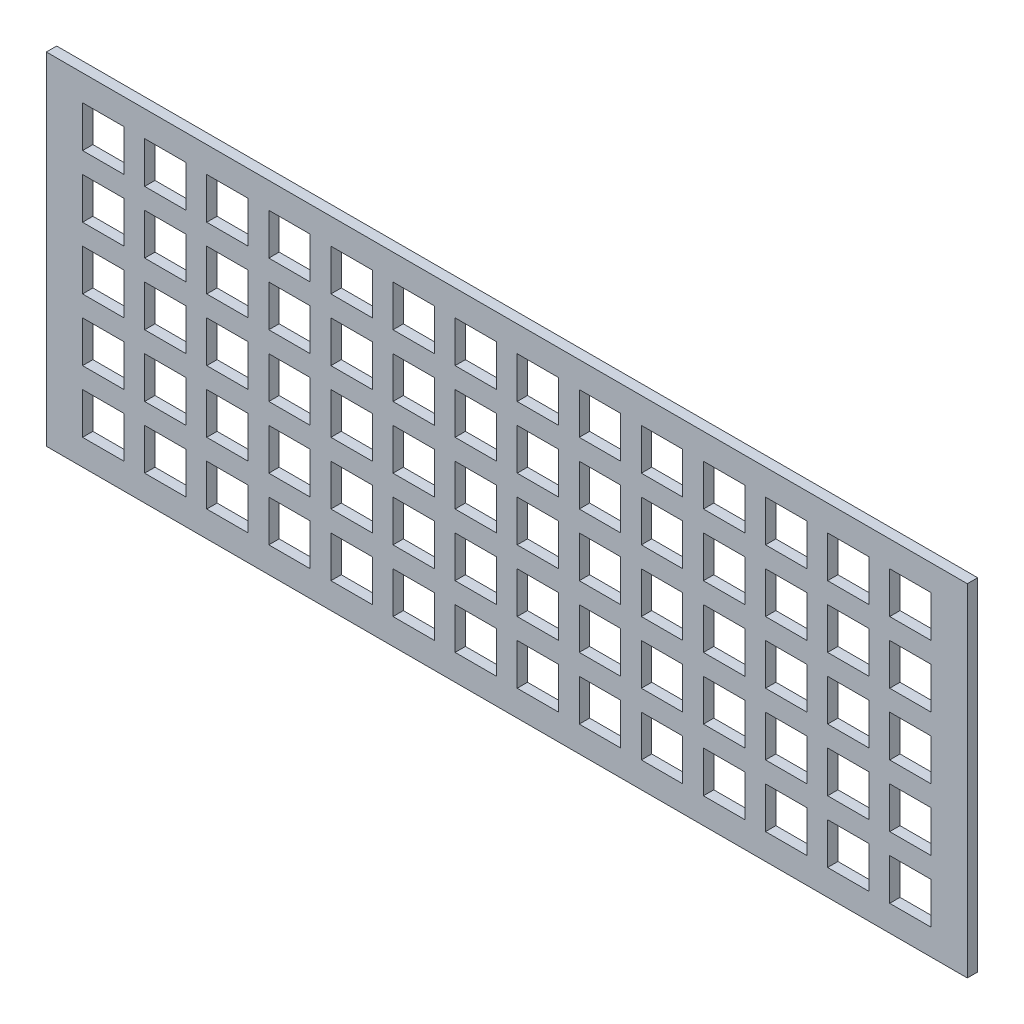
from build123d import *

# Parameters (mm, degrees)
SKETCH1_W           = 282.575
SKETCH1_H           = 104.775
BOSS_EXTRUDE1_DEPTH = 3.175
SKETCH3_W           = 12.7
SKETCH3_H           = 12.7
CUT_EXTRUDE1_DEPTH  = 151.720564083


with BuildPart() as part:
    # Sketch1 → Boss-Extrude1 (new body)
    with BuildSketch(Plane.XY):
        Rectangle(SKETCH1_W, SKETCH1_H)
    extrude(amount=BOSS_EXTRUDE1_DEPTH)

    # Sketch3 → Cut-Extrude1 (cut, through all)
    with BuildSketch(Plane.XY.offset(3.175)):
        with Locations((-123.825, -38.1)):
            Rectangle(SKETCH3_W, SKETCH3_H)
        with Locations((-104.775, -38.1)):
            Rectangle(SKETCH3_W, SKETCH3_H)
        with Locations((-85.725, -38.1)):
            Rectangle(SKETCH3_W, SKETCH3_H)
        with Locations((-66.675, -38.1)):
            Rectangle(SKETCH3_W, SKETCH3_H)
        with Locations((-47.625, -38.1)):
            Rectangle(SKETCH3_W, SKETCH3_H)
        with Locations((-28.575, -38.1)):
            Rectangle(SKETCH3_W, SKETCH3_H)
        with Locations((-104.775, -19.05)):
            Rectangle(SKETCH3_W, SKETCH3_H)
        with Locations((-85.725, -19.05)):
            Rectangle(SKETCH3_W, SKETCH3_H)
        with Locations((-66.675, -19.05)):
            Rectangle(SKETCH3_W, SKETCH3_H)
        with Locations((-47.625, -19.05)):
            Rectangle(SKETCH3_W, SKETCH3_H)
        with Locations((-28.575, -19.05)):
            Rectangle(SKETCH3_W, SKETCH3_H)
        with Locations((-104.775, 0)):
            Rectangle(SKETCH3_W, SKETCH3_H)
        with Locations((-85.725, 0)):
            Rectangle(SKETCH3_W, SKETCH3_H)
        with Locations((-66.675, 0)):
            Rectangle(SKETCH3_W, SKETCH3_H)
        with Locations((-47.625, 0)):
            Rectangle(SKETCH3_W, SKETCH3_H)
        with Locations((-28.575, 0)):
            Rectangle(SKETCH3_W, SKETCH3_H)
        with Locations((-104.775, 19.05)):
            Rectangle(SKETCH3_W, SKETCH3_H)
        with Locations((-85.725, 19.05)):
            Rectangle(SKETCH3_W, SKETCH3_H)
        with Locations((-66.675, 19.05)):
            Rectangle(SKETCH3_W, SKETCH3_H)
        with Locations((-47.625, 19.05)):
            Rectangle(SKETCH3_W, SKETCH3_H)
        with Locations((-28.575, 19.05)):
            Rectangle(SKETCH3_W, SKETCH3_H)
        with Locations((-104.775, 38.1)):
            Rectangle(SKETCH3_W, SKETCH3_H)
        with Locations((-85.725, 38.1)):
            Rectangle(SKETCH3_W, SKETCH3_H)
        with Locations((-66.675, 38.1)):
            Rectangle(SKETCH3_W, SKETCH3_H)
        with Locations((-47.625, 38.1)):
            Rectangle(SKETCH3_W, SKETCH3_H)
        with Locations((-28.575, 38.1)):
            Rectangle(SKETCH3_W, SKETCH3_H)
        with Locations((-123.825, -19.05)):
            Rectangle(SKETCH3_W, SKETCH3_H)
        with Locations((-123.825, 0)):
            Rectangle(SKETCH3_W, SKETCH3_H)
        with Locations((-123.825, 19.05)):
            Rectangle(SKETCH3_W, SKETCH3_H)
        with Locations((-123.825, 38.1)):
            Rectangle(SKETCH3_W, SKETCH3_H)
        with Locations((-9.525, -38.1)):
            Rectangle(SKETCH3_W, SKETCH3_H)
        with Locations((9.525, -38.1)):
            Rectangle(SKETCH3_W, SKETCH3_H)
        with Locations((28.575, -38.1)):
            Rectangle(SKETCH3_W, SKETCH3_H)
        with Locations((47.625, -38.1)):
            Rectangle(SKETCH3_W, SKETCH3_H)
        with Locations((66.675, -38.1)):
            Rectangle(SKETCH3_W, SKETCH3_H)
        with Locations((85.725, -38.1)):
            Rectangle(SKETCH3_W, SKETCH3_H)
        with Locations((104.775, -38.1)):
            Rectangle(SKETCH3_W, SKETCH3_H)
        with Locations((123.825, -38.1)):
            Rectangle(SKETCH3_W, SKETCH3_H)
        with Locations((-9.525, -19.05)):
            Rectangle(SKETCH3_W, SKETCH3_H)
        with Locations((9.525, -19.05)):
            Rectangle(SKETCH3_W, SKETCH3_H)
        with Locations((28.575, -19.05)):
            Rectangle(SKETCH3_W, SKETCH3_H)
        with Locations((47.625, -19.05)):
            Rectangle(SKETCH3_W, SKETCH3_H)
        with Locations((66.675, -19.05)):
            Rectangle(SKETCH3_W, SKETCH3_H)
        with Locations((85.725, -19.05)):
            Rectangle(SKETCH3_W, SKETCH3_H)
        with Locations((104.775, -19.05)):
            Rectangle(SKETCH3_W, SKETCH3_H)
        with Locations((123.825, -19.05)):
            Rectangle(SKETCH3_W, SKETCH3_H)
        with Locations((-9.525, 0)):
            Rectangle(SKETCH3_W, SKETCH3_H)
        with Locations((9.525, 0)):
            Rectangle(SKETCH3_W, SKETCH3_H)
        with Locations((28.575, 0)):
            Rectangle(SKETCH3_W, SKETCH3_H)
        with Locations((47.625, 0)):
            Rectangle(SKETCH3_W, SKETCH3_H)
        with Locations((66.675, 0)):
            Rectangle(SKETCH3_W, SKETCH3_H)
        with Locations((85.725, 0)):
            Rectangle(SKETCH3_W, SKETCH3_H)
        with Locations((104.775, 0)):
            Rectangle(SKETCH3_W, SKETCH3_H)
        with Locations((123.825, 0)):
            Rectangle(SKETCH3_W, SKETCH3_H)
        with Locations((-9.525, 19.05)):
            Rectangle(SKETCH3_W, SKETCH3_H)
        with Locations((9.525, 19.05)):
            Rectangle(SKETCH3_W, SKETCH3_H)
        with Locations((28.575, 19.05)):
            Rectangle(SKETCH3_W, SKETCH3_H)
        with Locations((47.625, 19.05)):
            Rectangle(SKETCH3_W, SKETCH3_H)
        with Locations((66.675, 19.05)):
            Rectangle(SKETCH3_W, SKETCH3_H)
        with Locations((85.725, 19.05)):
            Rectangle(SKETCH3_W, SKETCH3_H)
        with Locations((104.775, 19.05)):
            Rectangle(SKETCH3_W, SKETCH3_H)
        with Locations((123.825, 19.05)):
            Rectangle(SKETCH3_W, SKETCH3_H)
        with Locations((-9.525, 38.1)):
            Rectangle(SKETCH3_W, SKETCH3_H)
        with Locations((9.525, 38.1)):
            Rectangle(SKETCH3_W, SKETCH3_H)
        with Locations((28.575, 38.1)):
            Rectangle(SKETCH3_W, SKETCH3_H)
        with Locations((47.625, 38.1)):
            Rectangle(SKETCH3_W, SKETCH3_H)
        with Locations((66.675, 38.1)):
            Rectangle(SKETCH3_W, SKETCH3_H)
        with Locations((85.725, 38.1)):
            Rectangle(SKETCH3_W, SKETCH3_H)
        with Locations((104.775, 38.1)):
            Rectangle(SKETCH3_W, SKETCH3_H)
        with Locations((123.825, 38.1)):
            Rectangle(SKETCH3_W, SKETCH3_H)
    extrude(amount=-CUT_EXTRUDE1_DEPTH, mode=Mode.SUBTRACT)


solid = part.part
